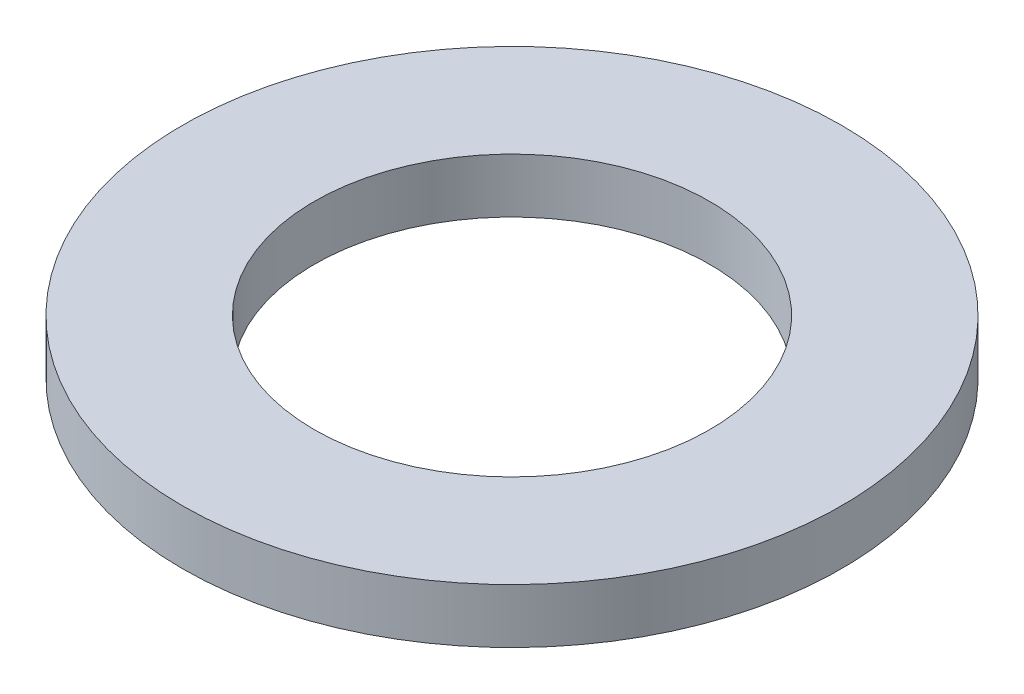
ISO-10303-21;
HEADER;
FILE_DESCRIPTION(('STEP AP214'),'2;1');
FILE_NAME('part.step','',(''),(''),'','','');
FILE_SCHEMA(('AUTOMOTIVE_DESIGN { 1 0 10303 214 1 1 1 1 }'));
ENDSEC;
DATA;
#1=APPLICATION_CONTEXT('core data for automotive mechanical design processes');
#2=APPLICATION_PROTOCOL_DEFINITION('international standard','automotive_design',2000,#1);
#3=PRODUCT_CONTEXT('',#1,'mechanical');
#4=PRODUCT('Part','Part','',(#3));
#5=PRODUCT_RELATED_PRODUCT_CATEGORY('part','',(#4));
#6=PRODUCT_DEFINITION_FORMATION('','',#4);
#7=PRODUCT_DEFINITION_CONTEXT('part definition',#1,'design');
#8=PRODUCT_DEFINITION('design','',#6,#7);
#9=PRODUCT_DEFINITION_SHAPE('','',#8);
#10=(LENGTH_UNIT() NAMED_UNIT(*) SI_UNIT(.MILLI.,.METRE.));
#11=(NAMED_UNIT(*) PLANE_ANGLE_UNIT() SI_UNIT($,.RADIAN.));
#12=(NAMED_UNIT(*) SI_UNIT($,.STERADIAN.) SOLID_ANGLE_UNIT());
#13=UNCERTAINTY_MEASURE_WITH_UNIT(LENGTH_MEASURE(1.E-05),#10,'distance_accuracy_value','');
#14=(GEOMETRIC_REPRESENTATION_CONTEXT(3) GLOBAL_UNCERTAINTY_ASSIGNED_CONTEXT((#13)) GLOBAL_UNIT_ASSIGNED_CONTEXT((#10,
#11,#12)) REPRESENTATION_CONTEXT('',''));
#15=CARTESIAN_POINT('',(0.,0.,0.));
#16=DIRECTION('',(0.,0.,1.));
#17=DIRECTION('',(1.,0.,0.));
#18=AXIS2_PLACEMENT_3D('',#15,#16,#17);
#19=CARTESIAN_POINT('',(0.,12.,0.));
#20=DIRECTION('',(0.,1.,0.));
#21=DIRECTION('',(0.,0.,1.));
#22=AXIS2_PLACEMENT_3D('',#19,#20,#21);
#23=PLANE('',#22);
#24=CARTESIAN_POINT('',(0.,12.,0.));
#25=DIRECTION('',(0.,1.,0.));
#26=DIRECTION('',(0.,0.,1.));
#27=AXIS2_PLACEMENT_3D('',#24,#25,#26);
#28=CIRCLE('',#27,72.5);
#29=CARTESIAN_POINT('',(0.,12.,72.5));
#30=VERTEX_POINT('',#29);
#31=EDGE_CURVE('E10',#30,#30,#28,.T.);
#32=ORIENTED_EDGE('',*,*,#31,.T.);
#33=EDGE_LOOP('',(#32));
#34=FACE_BOUND('',#33,.T.);
#35=CARTESIAN_POINT('',(0.,12.,0.));
#36=DIRECTION('',(0.,1.,0.));
#37=DIRECTION('',(0.,0.,1.));
#38=AXIS2_PLACEMENT_3D('',#35,#36,#37);
#39=CIRCLE('',#38,43.5);
#40=CARTESIAN_POINT('',(0.,12.,43.5));
#41=VERTEX_POINT('',#40);
#42=EDGE_CURVE('E39',#41,#41,#39,.T.);
#43=ORIENTED_EDGE('',*,*,#42,.F.);
#44=EDGE_LOOP('',(#43));
#45=FACE_BOUND('',#44,.T.);
#46=ADVANCED_FACE('F28',(#34,#45),#23,.T.);
#47=CARTESIAN_POINT('',(0.,0.,0.));
#48=DIRECTION('',(0.,1.,0.));
#49=DIRECTION('',(0.,0.,1.));
#50=AXIS2_PLACEMENT_3D('',#47,#48,#49);
#51=PLANE('',#50);
#52=CARTESIAN_POINT('',(0.,0.,0.));
#53=DIRECTION('',(0.,1.,0.));
#54=DIRECTION('',(0.,0.,1.));
#55=AXIS2_PLACEMENT_3D('',#52,#53,#54);
#56=CIRCLE('',#55,72.5);
#57=CARTESIAN_POINT('',(0.,0.,72.5));
#58=VERTEX_POINT('',#57);
#59=EDGE_CURVE('E35',#58,#58,#56,.T.);
#60=ORIENTED_EDGE('',*,*,#59,.F.);
#61=EDGE_LOOP('',(#60));
#62=FACE_BOUND('',#61,.T.);
#63=CARTESIAN_POINT('',(0.,0.,0.));
#64=DIRECTION('',(0.,1.,0.));
#65=DIRECTION('',(0.,0.,1.));
#66=AXIS2_PLACEMENT_3D('',#63,#64,#65);
#67=CIRCLE('',#66,43.5);
#68=CARTESIAN_POINT('',(0.,0.,43.5));
#69=VERTEX_POINT('',#68);
#70=EDGE_CURVE('E43',#69,#69,#67,.T.);
#71=ORIENTED_EDGE('',*,*,#70,.T.);
#72=EDGE_LOOP('',(#71));
#73=FACE_BOUND('',#72,.T.);
#74=ADVANCED_FACE('F49',(#62,#73),#51,.F.);
#75=CARTESIAN_POINT('',(0.,12.,0.));
#76=DIRECTION('',(0.,-1.,0.));
#77=DIRECTION('',(0.,0.,-1.));
#78=AXIS2_PLACEMENT_3D('',#75,#76,#77);
#79=CYLINDRICAL_SURFACE('',#78,72.5);
#80=ORIENTED_EDGE('',*,*,#31,.F.);
#81=EDGE_LOOP('',(#80));
#82=FACE_BOUND('',#81,.T.);
#83=ORIENTED_EDGE('',*,*,#59,.T.);
#84=EDGE_LOOP('',(#83));
#85=FACE_BOUND('',#84,.T.);
#86=ADVANCED_FACE('F30',(#82,#85),#79,.T.);
#87=CARTESIAN_POINT('',(0.,12.,0.));
#88=DIRECTION('',(0.,-1.,0.));
#89=DIRECTION('',(0.,0.,-1.));
#90=AXIS2_PLACEMENT_3D('',#87,#88,#89);
#91=CYLINDRICAL_SURFACE('',#90,43.5);
#92=ORIENTED_EDGE('',*,*,#42,.T.);
#93=EDGE_LOOP('',(#92));
#94=FACE_BOUND('',#93,.T.);
#95=ORIENTED_EDGE('',*,*,#70,.F.);
#96=EDGE_LOOP('',(#95));
#97=FACE_BOUND('',#96,.T.);
#98=ADVANCED_FACE('F51',(#94,#97),#91,.F.);
#99=CLOSED_SHELL('',(#46,#74,#86,#98));
#100=MANIFOLD_SOLID_BREP('B2',#99);
#101=ADVANCED_BREP_SHAPE_REPRESENTATION('',(#18,#100),#14);
#102=SHAPE_DEFINITION_REPRESENTATION(#9,#101);
ENDSEC;
END-ISO-10303-21;
